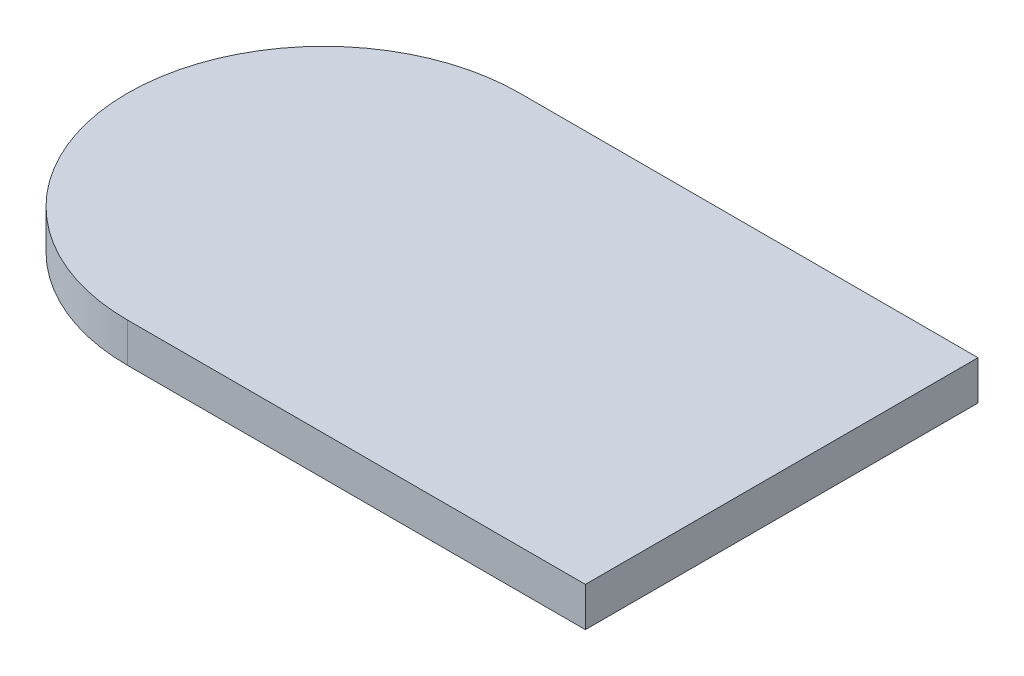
from build123d import *

# Parameters (mm, degrees)
BOSS_EXTRUDE1_DEPTH = 0.3


with BuildPart() as part:
    # Sketch1 → Boss-Extrude1 (new body)
    with BuildSketch(Plane(origin=(0, 0, 0), x_dir=(1, 0, 0), z_dir=(0, 1, 0))):
        with BuildLine():
            Line((0, -1.5), (3.5, -1.5))
            Line((3.5, -1.5), (3.5, 1.5))
            Line((3.5, 1.5), (0, 1.5))
            ThreePointArc((0, 1.5), (-1.5, 0), (0, -1.5))
        make_face()
    extrude(amount=BOSS_EXTRUDE1_DEPTH)


solid = part.part
